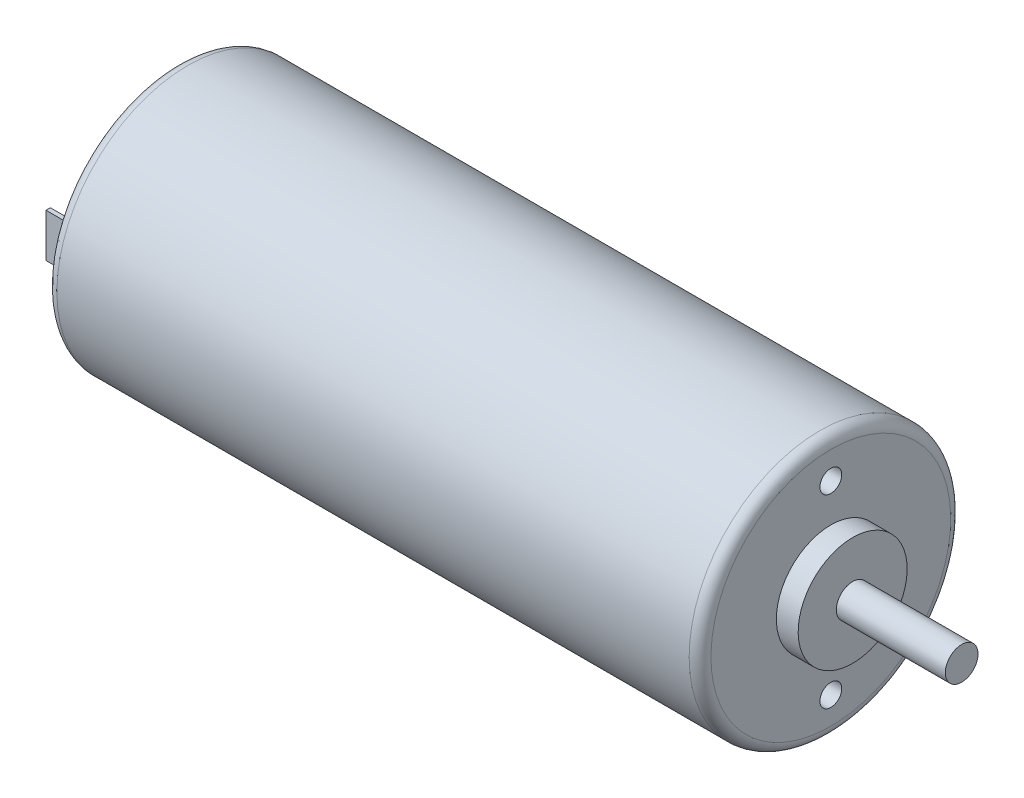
ISO-10303-21;
HEADER;
FILE_DESCRIPTION(('STEP AP214'),'2;1');
FILE_NAME('part.step','',(''),(''),'','','');
FILE_SCHEMA(('AUTOMOTIVE_DESIGN { 1 0 10303 214 1 1 1 1 }'));
ENDSEC;
DATA;
#1=APPLICATION_CONTEXT('core data for automotive mechanical design processes');
#2=APPLICATION_PROTOCOL_DEFINITION('international standard','automotive_design',2000,#1);
#3=PRODUCT_CONTEXT('',#1,'mechanical');
#4=PRODUCT('Part','Part','',(#3));
#5=PRODUCT_RELATED_PRODUCT_CATEGORY('part','',(#4));
#6=PRODUCT_DEFINITION_FORMATION('','',#4);
#7=PRODUCT_DEFINITION_CONTEXT('part definition',#1,'design');
#8=PRODUCT_DEFINITION('design','',#6,#7);
#9=PRODUCT_DEFINITION_SHAPE('','',#8);
#10=(LENGTH_UNIT() NAMED_UNIT(*) SI_UNIT(.MILLI.,.METRE.));
#11=(NAMED_UNIT(*) PLANE_ANGLE_UNIT() SI_UNIT($,.RADIAN.));
#12=(NAMED_UNIT(*) SI_UNIT($,.STERADIAN.) SOLID_ANGLE_UNIT());
#13=UNCERTAINTY_MEASURE_WITH_UNIT(LENGTH_MEASURE(1.E-05),#10,'distance_accuracy_value','');
#14=(GEOMETRIC_REPRESENTATION_CONTEXT(3) GLOBAL_UNCERTAINTY_ASSIGNED_CONTEXT((#13)) GLOBAL_UNIT_ASSIGNED_CONTEXT((#10,
#11,#12)) REPRESENTATION_CONTEXT('',''));
#15=CARTESIAN_POINT('',(0.,0.,0.));
#16=DIRECTION('',(0.,0.,1.));
#17=DIRECTION('',(1.,0.,0.));
#18=AXIS2_PLACEMENT_3D('',#15,#16,#17);
#19=CARTESIAN_POINT('',(-15.,2.49999999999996,0.));
#20=DIRECTION('',(-1.,0.,0.));
#21=DIRECTION('',(0.,-1.,0.));
#22=AXIS2_PLACEMENT_3D('',#19,#20,#21);
#23=PLANE('',#22);
#24=DIRECTION('',(0.,-1.,0.));
#25=VECTOR('',#24,1.);
#26=CARTESIAN_POINT('',(-15.,0.999999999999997,-4.));
#27=LINE('',#26,#25);
#28=CARTESIAN_POINT('',(-15.,0.999999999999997,-4.));
#29=VERTEX_POINT('',#28);
#30=CARTESIAN_POINT('',(-15.,-1.,-4.));
#31=VERTEX_POINT('',#30);
#32=EDGE_CURVE('E141',#29,#31,#27,.T.);
#33=ORIENTED_EDGE('',*,*,#32,.F.);
#34=DIRECTION('',(0.,0.,-1.));
#35=VECTOR('',#34,1.);
#36=CARTESIAN_POINT('',(-15.,0.999999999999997,-4.));
#37=LINE('',#36,#35);
#38=CARTESIAN_POINT('',(-15.,0.999999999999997,-3.8));
#39=VERTEX_POINT('',#38);
#40=EDGE_CURVE('E108',#39,#29,#37,.T.);
#41=ORIENTED_EDGE('',*,*,#40,.F.);
#42=DIRECTION('',(0.,1.,0.));
#43=VECTOR('',#42,1.);
#44=CARTESIAN_POINT('',(-15.,0.999999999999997,-3.8));
#45=LINE('',#44,#43);
#46=CARTESIAN_POINT('',(-15.,-1.,-3.8));
#47=VERTEX_POINT('',#46);
#48=EDGE_CURVE('E145',#47,#39,#45,.T.);
#49=ORIENTED_EDGE('',*,*,#48,.F.);
#50=DIRECTION('',(0.,0.,1.));
#51=VECTOR('',#50,1.);
#52=CARTESIAN_POINT('',(-15.,-1.,-3.8));
#53=LINE('',#52,#51);
#54=EDGE_CURVE('E143',#31,#47,#53,.T.);
#55=ORIENTED_EDGE('',*,*,#54,.F.);
#56=EDGE_LOOP('',(#33,#41,#49,#55));
#57=FACE_BOUND('',#56,.T.);
#58=CARTESIAN_POINT('',(-15.,0.,0.));
#59=DIRECTION('',(-1.,0.,0.));
#60=DIRECTION('',(0.,-1.,0.));
#61=AXIS2_PLACEMENT_3D('',#58,#59,#60);
#62=CIRCLE('',#61,5.49999999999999);
#63=CARTESIAN_POINT('',(-15.,-5.5,0.));
#64=VERTEX_POINT('',#63);
#65=EDGE_CURVE('E189',#64,#64,#62,.T.);
#66=ORIENTED_EDGE('',*,*,#65,.T.);
#67=EDGE_LOOP('',(#66));
#68=FACE_BOUND('',#67,.T.);
#69=CARTESIAN_POINT('',(-15.,0.,0.));
#70=DIRECTION('',(1.,0.,0.));
#71=DIRECTION('',(0.,1.,0.));
#72=AXIS2_PLACEMENT_3D('',#69,#70,#71);
#73=CIRCLE('',#72,2.49999999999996);
#74=CARTESIAN_POINT('',(-15.,2.49999999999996,0.));
#75=VERTEX_POINT('',#74);
#76=EDGE_CURVE('E177',#75,#75,#73,.T.);
#77=ORIENTED_EDGE('',*,*,#76,.T.);
#78=EDGE_LOOP('',(#77));
#79=FACE_BOUND('',#78,.T.);
#80=DIRECTION('',(0.,-1.,0.));
#81=VECTOR('',#80,1.);
#82=CARTESIAN_POINT('',(-15.,0.999999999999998,3.8));
#83=LINE('',#82,#81);
#84=CARTESIAN_POINT('',(-15.,0.999999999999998,3.8));
#85=VERTEX_POINT('',#84);
#86=CARTESIAN_POINT('',(-15.,-1.,3.8));
#87=VERTEX_POINT('',#86);
#88=EDGE_CURVE('E102',#85,#87,#83,.T.);
#89=ORIENTED_EDGE('',*,*,#88,.F.);
#90=DIRECTION('',(0.,0.,-1.));
#91=VECTOR('',#90,1.);
#92=CARTESIAN_POINT('',(-15.,0.999999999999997,4.));
#93=LINE('',#92,#91);
#94=CARTESIAN_POINT('',(-15.,0.999999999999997,4.));
#95=VERTEX_POINT('',#94);
#96=EDGE_CURVE('E113',#95,#85,#93,.T.);
#97=ORIENTED_EDGE('',*,*,#96,.F.);
#98=DIRECTION('',(0.,1.,0.));
#99=VECTOR('',#98,1.);
#100=CARTESIAN_POINT('',(-15.,0.999999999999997,4.));
#101=LINE('',#100,#99);
#102=CARTESIAN_POINT('',(-15.,-1.,4.));
#103=VERTEX_POINT('',#102);
#104=EDGE_CURVE('E124',#103,#95,#101,.T.);
#105=ORIENTED_EDGE('',*,*,#104,.F.);
#106=DIRECTION('',(0.,0.,1.));
#107=VECTOR('',#106,1.);
#108=CARTESIAN_POINT('',(-15.,-1.,3.8));
#109=LINE('',#108,#107);
#110=EDGE_CURVE('E122',#87,#103,#109,.T.);
#111=ORIENTED_EDGE('',*,*,#110,.F.);
#112=EDGE_LOOP('',(#89,#97,#105,#111));
#113=FACE_BOUND('',#112,.T.);
#114=ADVANCED_FACE('F31',(#57,#68,#79,#113),#23,.T.);
#115=CARTESIAN_POINT('',(-16.,0.,0.));
#116=DIRECTION('',(-1.,0.,0.));
#117=DIRECTION('',(0.,-1.,0.));
#118=AXIS2_PLACEMENT_3D('',#115,#116,#117);
#119=PLANE('',#118);
#120=CARTESIAN_POINT('',(-16.,0.,0.));
#121=DIRECTION('',(-1.,0.,0.));
#122=DIRECTION('',(0.,-1.,0.));
#123=AXIS2_PLACEMENT_3D('',#120,#121,#122);
#124=CIRCLE('',#123,1.99999999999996);
#125=CARTESIAN_POINT('',(-16.,-1.99999999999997,0.));
#126=VERTEX_POINT('',#125);
#127=EDGE_CURVE('E11',#126,#126,#124,.T.);
#128=ORIENTED_EDGE('',*,*,#127,.T.);
#129=EDGE_LOOP('',(#128));
#130=FACE_BOUND('',#129,.T.);
#131=ADVANCED_FACE('F33',(#130),#119,.T.);
#132=CARTESIAN_POINT('',(52.4688341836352,0.,0.));
#133=DIRECTION('',(1.,0.,0.));
#134=DIRECTION('',(0.,1.,0.));
#135=AXIS2_PLACEMENT_3D('',#132,#133,#134);
#136=CYLINDRICAL_SURFACE('',#135,2.49999999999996);
#137=CARTESIAN_POINT('',(-15.5,0.,0.));
#138=DIRECTION('',(-1.,0.,0.));
#139=DIRECTION('',(0.,-1.,0.));
#140=AXIS2_PLACEMENT_3D('',#137,#138,#139);
#141=CIRCLE('',#140,2.49999999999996);
#142=CARTESIAN_POINT('',(-15.5,-2.49999999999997,0.));
#143=VERTEX_POINT('',#142);
#144=EDGE_CURVE('E39',#143,#143,#141,.F.);
#145=ORIENTED_EDGE('',*,*,#144,.T.);
#146=EDGE_LOOP('',(#145));
#147=FACE_BOUND('',#146,.T.);
#148=ORIENTED_EDGE('',*,*,#76,.F.);
#149=EDGE_LOOP('',(#148));
#150=FACE_BOUND('',#149,.T.);
#151=ADVANCED_FACE('F194',(#147,#150),#136,.T.);
#152=CARTESIAN_POINT('',(52.4688341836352,0.,0.));
#153=DIRECTION('',(1.,0.,0.));
#154=DIRECTION('',(0.,1.,0.));
#155=AXIS2_PLACEMENT_3D('',#152,#153,#154);
#156=CYLINDRICAL_SURFACE('',#155,5.99999999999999);
#157=CARTESIAN_POINT('',(14.5,0.,0.));
#158=DIRECTION('',(1.,0.,0.));
#159=DIRECTION('',(0.,1.,0.));
#160=AXIS2_PLACEMENT_3D('',#157,#158,#159);
#161=CIRCLE('',#160,5.99999999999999);
#162=CARTESIAN_POINT('',(14.5,6.,0.));
#163=VERTEX_POINT('',#162);
#164=EDGE_CURVE('E186',#163,#163,#161,.F.);
#165=ORIENTED_EDGE('',*,*,#164,.T.);
#166=EDGE_LOOP('',(#165));
#167=FACE_BOUND('',#166,.T.);
#168=CARTESIAN_POINT('',(-14.5,0.,0.));
#169=DIRECTION('',(-1.,0.,0.));
#170=DIRECTION('',(0.,-1.,0.));
#171=AXIS2_PLACEMENT_3D('',#168,#169,#170);
#172=CIRCLE('',#171,5.99999999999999);
#173=CARTESIAN_POINT('',(-14.5,-6.,0.));
#174=VERTEX_POINT('',#173);
#175=EDGE_CURVE('E183',#174,#174,#172,.F.);
#176=ORIENTED_EDGE('',*,*,#175,.T.);
#177=EDGE_LOOP('',(#176));
#178=FACE_BOUND('',#177,.T.);
#179=ADVANCED_FACE('F224',(#167,#178),#156,.T.);
#180=CARTESIAN_POINT('',(15.,6.,0.));
#181=DIRECTION('',(1.,0.,0.));
#182=DIRECTION('',(0.,1.,0.));
#183=AXIS2_PLACEMENT_3D('',#180,#181,#182);
#184=PLANE('',#183);
#185=CARTESIAN_POINT('',(15.,4.25,0.));
#186=DIRECTION('',(1.,0.,0.));
#187=DIRECTION('',(0.,1.,0.));
#188=AXIS2_PLACEMENT_3D('',#185,#186,#187);
#189=CIRCLE('',#188,0.5);
#190=CARTESIAN_POINT('',(15.,4.75,0.));
#191=VERTEX_POINT('',#190);
#192=EDGE_CURVE('E436',#191,#191,#189,.T.);
#193=ORIENTED_EDGE('',*,*,#192,.F.);
#194=EDGE_LOOP('',(#193));
#195=FACE_BOUND('',#194,.T.);
#196=CARTESIAN_POINT('',(15.,-4.25,0.));
#197=DIRECTION('',(1.,0.,0.));
#198=DIRECTION('',(0.,1.,0.));
#199=AXIS2_PLACEMENT_3D('',#196,#197,#198);
#200=CIRCLE('',#199,0.5);
#201=CARTESIAN_POINT('',(15.,-3.75,0.));
#202=VERTEX_POINT('',#201);
#203=EDGE_CURVE('E435',#202,#202,#200,.T.);
#204=ORIENTED_EDGE('',*,*,#203,.F.);
#205=EDGE_LOOP('',(#204));
#206=FACE_BOUND('',#205,.T.);
#207=CARTESIAN_POINT('',(15.,0.,0.));
#208=DIRECTION('',(1.,0.,0.));
#209=DIRECTION('',(0.,1.,0.));
#210=AXIS2_PLACEMENT_3D('',#207,#208,#209);
#211=CIRCLE('',#210,5.49999999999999);
#212=CARTESIAN_POINT('',(15.,5.5,0.));
#213=VERTEX_POINT('',#212);
#214=EDGE_CURVE('E180',#213,#213,#211,.T.);
#215=ORIENTED_EDGE('',*,*,#214,.T.);
#216=EDGE_LOOP('',(#215));
#217=FACE_BOUND('',#216,.T.);
#218=CARTESIAN_POINT('',(15.,0.,0.));
#219=DIRECTION('',(1.,0.,0.));
#220=DIRECTION('',(0.,1.,0.));
#221=AXIS2_PLACEMENT_3D('',#218,#219,#220);
#222=CIRCLE('',#221,2.5);
#223=CARTESIAN_POINT('',(15.,2.5,0.));
#224=VERTEX_POINT('',#223);
#225=EDGE_CURVE('E174',#224,#224,#222,.T.);
#226=ORIENTED_EDGE('',*,*,#225,.F.);
#227=EDGE_LOOP('',(#226));
#228=FACE_BOUND('',#227,.T.);
#229=ADVANCED_FACE('F230',(#195,#206,#217,#228),#184,.T.);
#230=CARTESIAN_POINT('',(52.4688341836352,0.,0.));
#231=DIRECTION('',(1.,0.,0.));
#232=DIRECTION('',(0.,1.,0.));
#233=AXIS2_PLACEMENT_3D('',#230,#231,#232);
#234=CYLINDRICAL_SURFACE('',#233,2.5);
#235=ORIENTED_EDGE('',*,*,#225,.T.);
#236=EDGE_LOOP('',(#235));
#237=FACE_BOUND('',#236,.T.);
#238=CARTESIAN_POINT('',(16.,0.,0.));
#239=DIRECTION('',(1.,0.,0.));
#240=DIRECTION('',(0.,1.,0.));
#241=AXIS2_PLACEMENT_3D('',#238,#239,#240);
#242=CIRCLE('',#241,2.5);
#243=CARTESIAN_POINT('',(16.,2.5,0.));
#244=VERTEX_POINT('',#243);
#245=EDGE_CURVE('E171',#244,#244,#242,.T.);
#246=ORIENTED_EDGE('',*,*,#245,.F.);
#247=EDGE_LOOP('',(#246));
#248=FACE_BOUND('',#247,.T.);
#249=ADVANCED_FACE('F235',(#237,#248),#234,.T.);
#250=CARTESIAN_POINT('',(16.,2.5,0.));
#251=DIRECTION('',(1.,0.,0.));
#252=DIRECTION('',(0.,1.,0.));
#253=AXIS2_PLACEMENT_3D('',#250,#251,#252);
#254=PLANE('',#253);
#255=ORIENTED_EDGE('',*,*,#245,.T.);
#256=EDGE_LOOP('',(#255));
#257=FACE_BOUND('',#256,.T.);
#258=CARTESIAN_POINT('',(16.,0.,0.));
#259=DIRECTION('',(1.,0.,0.));
#260=DIRECTION('',(0.,1.,0.));
#261=AXIS2_PLACEMENT_3D('',#258,#259,#260);
#262=CIRCLE('',#261,0.749999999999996);
#263=CARTESIAN_POINT('',(16.,0.75,0.));
#264=VERTEX_POINT('',#263);
#265=EDGE_CURVE('E168',#264,#264,#262,.T.);
#266=ORIENTED_EDGE('',*,*,#265,.F.);
#267=EDGE_LOOP('',(#266));
#268=FACE_BOUND('',#267,.T.);
#269=ADVANCED_FACE('F253',(#257,#268),#254,.T.);
#270=CARTESIAN_POINT('',(52.4688341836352,0.,0.));
#271=DIRECTION('',(1.,0.,0.));
#272=DIRECTION('',(0.,1.,0.));
#273=AXIS2_PLACEMENT_3D('',#270,#271,#272);
#274=CYLINDRICAL_SURFACE('',#273,0.749999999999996);
#275=ORIENTED_EDGE('',*,*,#265,.T.);
#276=EDGE_LOOP('',(#275));
#277=FACE_BOUND('',#276,.T.);
#278=CARTESIAN_POINT('',(21.,0.,0.));
#279=DIRECTION('',(1.,0.,0.));
#280=DIRECTION('',(0.,1.,0.));
#281=AXIS2_PLACEMENT_3D('',#278,#279,#280);
#282=CIRCLE('',#281,0.749999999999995);
#283=CARTESIAN_POINT('',(21.,0.75,0.));
#284=VERTEX_POINT('',#283);
#285=EDGE_CURVE('E165',#284,#284,#282,.T.);
#286=ORIENTED_EDGE('',*,*,#285,.F.);
#287=EDGE_LOOP('',(#286));
#288=FACE_BOUND('',#287,.T.);
#289=ADVANCED_FACE('F259',(#277,#288),#274,.T.);
#290=CARTESIAN_POINT('',(21.,0.75,0.));
#291=DIRECTION('',(1.,0.,0.));
#292=DIRECTION('',(0.,1.,0.));
#293=AXIS2_PLACEMENT_3D('',#290,#291,#292);
#294=PLANE('',#293);
#295=ORIENTED_EDGE('',*,*,#285,.T.);
#296=EDGE_LOOP('',(#295));
#297=FACE_BOUND('',#296,.T.);
#298=ADVANCED_FACE('F244',(#297),#294,.T.);
#299=CARTESIAN_POINT('',(14.5,0.,0.));
#300=DIRECTION('',(1.,0.,0.));
#301=DIRECTION('',(0.,1.,0.));
#302=AXIS2_PLACEMENT_3D('',#299,#300,#301);
#303=TOROIDAL_SURFACE('',#302,5.49999999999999,0.5);
#304=ORIENTED_EDGE('',*,*,#164,.F.);
#305=EDGE_LOOP('',(#304));
#306=FACE_BOUND('',#305,.T.);
#307=ORIENTED_EDGE('',*,*,#214,.F.);
#308=EDGE_LOOP('',(#307));
#309=FACE_BOUND('',#308,.T.);
#310=ADVANCED_FACE('F210',(#306,#309),#303,.T.);
#311=CARTESIAN_POINT('',(-14.5,0.,0.));
#312=DIRECTION('',(-1.,0.,0.));
#313=DIRECTION('',(0.,-1.,0.));
#314=AXIS2_PLACEMENT_3D('',#311,#312,#313);
#315=TOROIDAL_SURFACE('',#314,5.49999999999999,0.5);
#316=ORIENTED_EDGE('',*,*,#65,.F.);
#317=EDGE_LOOP('',(#316));
#318=FACE_BOUND('',#317,.T.);
#319=ORIENTED_EDGE('',*,*,#175,.F.);
#320=EDGE_LOOP('',(#319));
#321=FACE_BOUND('',#320,.T.);
#322=ADVANCED_FACE('F200',(#318,#321),#315,.T.);
#323=CARTESIAN_POINT('',(-15.5,0.,0.));
#324=DIRECTION('',(-1.,0.,0.));
#325=DIRECTION('',(0.,-1.,0.));
#326=AXIS2_PLACEMENT_3D('',#323,#324,#325);
#327=TOROIDAL_SURFACE('',#326,1.99999999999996,0.5);
#328=ORIENTED_EDGE('',*,*,#127,.F.);
#329=EDGE_LOOP('',(#328));
#330=FACE_BOUND('',#329,.T.);
#331=ORIENTED_EDGE('',*,*,#144,.F.);
#332=EDGE_LOOP('',(#331));
#333=FACE_BOUND('',#332,.T.);
#334=ADVANCED_FACE('F197',(#330,#333),#327,.T.);
#335=CARTESIAN_POINT('',(-17.,0.999999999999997,-4.));
#336=DIRECTION('',(0.,-1.,0.));
#337=DIRECTION('',(1.,0.,0.));
#338=AXIS2_PLACEMENT_3D('',#335,#336,#337);
#339=PLANE('',#338);
#340=ORIENTED_EDGE('',*,*,#40,.T.);
#341=DIRECTION('',(1.,0.,0.));
#342=VECTOR('',#341,1.);
#343=CARTESIAN_POINT('',(-17.,0.999999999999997,-4.));
#344=LINE('',#343,#342);
#345=CARTESIAN_POINT('',(-17.,0.999999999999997,-4.));
#346=VERTEX_POINT('',#345);
#347=EDGE_CURVE('E163',#346,#29,#344,.T.);
#348=ORIENTED_EDGE('',*,*,#347,.F.);
#349=DIRECTION('',(0.,0.,-1.));
#350=VECTOR('',#349,1.);
#351=CARTESIAN_POINT('',(-17.,0.999999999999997,-4.));
#352=LINE('',#351,#350);
#353=CARTESIAN_POINT('',(-17.,0.999999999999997,-3.8));
#354=VERTEX_POINT('',#353);
#355=EDGE_CURVE('E147',#354,#346,#352,.T.);
#356=ORIENTED_EDGE('',*,*,#355,.F.);
#357=DIRECTION('',(1.,0.,0.));
#358=VECTOR('',#357,1.);
#359=CARTESIAN_POINT('',(-17.,0.999999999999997,-3.8));
#360=LINE('',#359,#358);
#361=EDGE_CURVE('E156',#354,#39,#360,.T.);
#362=ORIENTED_EDGE('',*,*,#361,.T.);
#363=EDGE_LOOP('',(#340,#348,#356,#362));
#364=FACE_BOUND('',#363,.T.);
#365=ADVANCED_FACE('F199',(#364),#339,.F.);
#366=CARTESIAN_POINT('',(-17.,0.999999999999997,-4.));
#367=DIRECTION('',(0.,0.,1.));
#368=DIRECTION('',(1.,0.,0.));
#369=AXIS2_PLACEMENT_3D('',#366,#367,#368);
#370=PLANE('',#369);
#371=ORIENTED_EDGE('',*,*,#32,.T.);
#372=DIRECTION('',(1.,0.,0.));
#373=VECTOR('',#372,1.);
#374=CARTESIAN_POINT('',(-17.,-1.,-4.));
#375=LINE('',#374,#373);
#376=CARTESIAN_POINT('',(-17.,-1.,-4.));
#377=VERTEX_POINT('',#376);
#378=EDGE_CURVE('E160',#377,#31,#375,.T.);
#379=ORIENTED_EDGE('',*,*,#378,.F.);
#380=DIRECTION('',(0.,-1.,0.));
#381=VECTOR('',#380,1.);
#382=CARTESIAN_POINT('',(-17.,0.999999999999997,-4.));
#383=LINE('',#382,#381);
#384=EDGE_CURVE('E150',#346,#377,#383,.T.);
#385=ORIENTED_EDGE('',*,*,#384,.F.);
#386=ORIENTED_EDGE('',*,*,#347,.T.);
#387=EDGE_LOOP('',(#371,#379,#385,#386));
#388=FACE_BOUND('',#387,.T.);
#389=ADVANCED_FACE('F207',(#388),#370,.F.);
#390=CARTESIAN_POINT('',(-17.,-1.,-3.8));
#391=DIRECTION('',(0.,1.,0.));
#392=DIRECTION('',(-1.,0.,0.));
#393=AXIS2_PLACEMENT_3D('',#390,#391,#392);
#394=PLANE('',#393);
#395=ORIENTED_EDGE('',*,*,#54,.T.);
#396=DIRECTION('',(1.,0.,0.));
#397=VECTOR('',#396,1.);
#398=CARTESIAN_POINT('',(-17.,-1.,-3.8));
#399=LINE('',#398,#397);
#400=CARTESIAN_POINT('',(-17.,-1.,-3.8));
#401=VERTEX_POINT('',#400);
#402=EDGE_CURVE('E54',#401,#47,#399,.T.);
#403=ORIENTED_EDGE('',*,*,#402,.F.);
#404=DIRECTION('',(0.,0.,1.));
#405=VECTOR('',#404,1.);
#406=CARTESIAN_POINT('',(-17.,-1.,-3.8));
#407=LINE('',#406,#405);
#408=EDGE_CURVE('E152',#377,#401,#407,.T.);
#409=ORIENTED_EDGE('',*,*,#408,.F.);
#410=ORIENTED_EDGE('',*,*,#378,.T.);
#411=EDGE_LOOP('',(#395,#403,#409,#410));
#412=FACE_BOUND('',#411,.T.);
#413=ADVANCED_FACE('F306',(#412),#394,.F.);
#414=CARTESIAN_POINT('',(-17.,0.999999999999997,-3.8));
#415=DIRECTION('',(0.,0.,-1.));
#416=DIRECTION('',(0.,1.,0.));
#417=AXIS2_PLACEMENT_3D('',#414,#415,#416);
#418=PLANE('',#417);
#419=ORIENTED_EDGE('',*,*,#48,.T.);
#420=ORIENTED_EDGE('',*,*,#361,.F.);
#421=DIRECTION('',(0.,1.,0.));
#422=VECTOR('',#421,1.);
#423=CARTESIAN_POINT('',(-17.,0.999999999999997,-3.8));
#424=LINE('',#423,#422);
#425=EDGE_CURVE('E154',#401,#354,#424,.T.);
#426=ORIENTED_EDGE('',*,*,#425,.F.);
#427=ORIENTED_EDGE('',*,*,#402,.T.);
#428=EDGE_LOOP('',(#419,#420,#426,#427));
#429=FACE_BOUND('',#428,.T.);
#430=ADVANCED_FACE('F316',(#429),#418,.F.);
#431=CARTESIAN_POINT('',(-17.,0.999999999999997,-4.));
#432=DIRECTION('',(1.,0.,0.));
#433=DIRECTION('',(0.,0.,-1.));
#434=AXIS2_PLACEMENT_3D('',#431,#432,#433);
#435=PLANE('',#434);
#436=ORIENTED_EDGE('',*,*,#355,.T.);
#437=ORIENTED_EDGE('',*,*,#384,.T.);
#438=ORIENTED_EDGE('',*,*,#408,.T.);
#439=ORIENTED_EDGE('',*,*,#425,.T.);
#440=EDGE_LOOP('',(#436,#437,#438,#439));
#441=FACE_BOUND('',#440,.T.);
#442=ADVANCED_FACE('F326',(#441),#435,.F.);
#443=CARTESIAN_POINT('',(-17.,0.999999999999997,4.));
#444=DIRECTION('',(0.,-1.,0.));
#445=DIRECTION('',(0.,0.,-1.));
#446=AXIS2_PLACEMENT_3D('',#443,#444,#445);
#447=PLANE('',#446);
#448=ORIENTED_EDGE('',*,*,#96,.T.);
#449=DIRECTION('',(1.,0.,0.));
#450=VECTOR('',#449,1.);
#451=CARTESIAN_POINT('',(-17.,0.999999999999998,3.8));
#452=LINE('',#451,#450);
#453=CARTESIAN_POINT('',(-17.,0.999999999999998,3.8));
#454=VERTEX_POINT('',#453);
#455=EDGE_CURVE('E97',#454,#85,#452,.T.);
#456=ORIENTED_EDGE('',*,*,#455,.F.);
#457=DIRECTION('',(0.,0.,-1.));
#458=VECTOR('',#457,1.);
#459=CARTESIAN_POINT('',(-17.,0.999999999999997,4.));
#460=LINE('',#459,#458);
#461=CARTESIAN_POINT('',(-17.,0.999999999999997,4.));
#462=VERTEX_POINT('',#461);
#463=EDGE_CURVE('E129',#462,#454,#460,.T.);
#464=ORIENTED_EDGE('',*,*,#463,.F.);
#465=DIRECTION('',(1.,0.,0.));
#466=VECTOR('',#465,1.);
#467=CARTESIAN_POINT('',(-17.,0.999999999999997,4.));
#468=LINE('',#467,#466);
#469=EDGE_CURVE('E116',#462,#95,#468,.T.);
#470=ORIENTED_EDGE('',*,*,#469,.T.);
#471=EDGE_LOOP('',(#448,#456,#464,#470));
#472=FACE_BOUND('',#471,.T.);
#473=ADVANCED_FACE('F114',(#472),#447,.F.);
#474=CARTESIAN_POINT('',(-17.,0.999999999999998,3.8));
#475=DIRECTION('',(0.,0.,1.));
#476=DIRECTION('',(1.,0.,0.));
#477=AXIS2_PLACEMENT_3D('',#474,#475,#476);
#478=PLANE('',#477);
#479=ORIENTED_EDGE('',*,*,#88,.T.);
#480=DIRECTION('',(1.,0.,0.));
#481=VECTOR('',#480,1.);
#482=CARTESIAN_POINT('',(-17.,-1.,3.8));
#483=LINE('',#482,#481);
#484=CARTESIAN_POINT('',(-17.,-1.,3.8));
#485=VERTEX_POINT('',#484);
#486=EDGE_CURVE('E109',#485,#87,#483,.T.);
#487=ORIENTED_EDGE('',*,*,#486,.F.);
#488=DIRECTION('',(0.,-1.,0.));
#489=VECTOR('',#488,1.);
#490=CARTESIAN_POINT('',(-17.,0.999999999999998,3.8));
#491=LINE('',#490,#489);
#492=EDGE_CURVE('E104',#454,#485,#491,.T.);
#493=ORIENTED_EDGE('',*,*,#492,.F.);
#494=ORIENTED_EDGE('',*,*,#455,.T.);
#495=EDGE_LOOP('',(#479,#487,#493,#494));
#496=FACE_BOUND('',#495,.T.);
#497=ADVANCED_FACE('F99',(#496),#478,.F.);
#498=CARTESIAN_POINT('',(-17.,-1.,3.8));
#499=DIRECTION('',(0.,1.,0.));
#500=DIRECTION('',(0.,0.,1.));
#501=AXIS2_PLACEMENT_3D('',#498,#499,#500);
#502=PLANE('',#501);
#503=ORIENTED_EDGE('',*,*,#110,.T.);
#504=DIRECTION('',(1.,0.,0.));
#505=VECTOR('',#504,1.);
#506=CARTESIAN_POINT('',(-17.,-1.,4.));
#507=LINE('',#506,#505);
#508=CARTESIAN_POINT('',(-17.,-1.,4.));
#509=VERTEX_POINT('',#508);
#510=EDGE_CURVE('E46',#509,#103,#507,.T.);
#511=ORIENTED_EDGE('',*,*,#510,.F.);
#512=DIRECTION('',(0.,0.,1.));
#513=VECTOR('',#512,1.);
#514=CARTESIAN_POINT('',(-17.,-1.,3.8));
#515=LINE('',#514,#513);
#516=EDGE_CURVE('E132',#485,#509,#515,.T.);
#517=ORIENTED_EDGE('',*,*,#516,.F.);
#518=ORIENTED_EDGE('',*,*,#486,.T.);
#519=EDGE_LOOP('',(#503,#511,#517,#518));
#520=FACE_BOUND('',#519,.T.);
#521=ADVANCED_FACE('F352',(#520),#502,.F.);
#522=CARTESIAN_POINT('',(-17.,0.999999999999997,4.));
#523=DIRECTION('',(0.,0.,-1.));
#524=DIRECTION('',(-1.,0.,0.));
#525=AXIS2_PLACEMENT_3D('',#522,#523,#524);
#526=PLANE('',#525);
#527=ORIENTED_EDGE('',*,*,#104,.T.);
#528=ORIENTED_EDGE('',*,*,#469,.F.);
#529=DIRECTION('',(0.,1.,0.));
#530=VECTOR('',#529,1.);
#531=CARTESIAN_POINT('',(-17.,0.999999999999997,4.));
#532=LINE('',#531,#530);
#533=EDGE_CURVE('E134',#509,#462,#532,.T.);
#534=ORIENTED_EDGE('',*,*,#533,.F.);
#535=ORIENTED_EDGE('',*,*,#510,.T.);
#536=EDGE_LOOP('',(#527,#528,#534,#535));
#537=FACE_BOUND('',#536,.T.);
#538=ADVANCED_FACE('F361',(#537),#526,.F.);
#539=CARTESIAN_POINT('',(-17.,0.999999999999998,3.8));
#540=DIRECTION('',(-1.,0.,0.));
#541=DIRECTION('',(0.,0.,1.));
#542=AXIS2_PLACEMENT_3D('',#539,#540,#541);
#543=PLANE('',#542);
#544=ORIENTED_EDGE('',*,*,#463,.T.);
#545=ORIENTED_EDGE('',*,*,#492,.T.);
#546=ORIENTED_EDGE('',*,*,#516,.T.);
#547=ORIENTED_EDGE('',*,*,#533,.T.);
#548=EDGE_LOOP('',(#544,#545,#546,#547));
#549=FACE_BOUND('',#548,.T.);
#550=ADVANCED_FACE('F371',(#549),#543,.T.);
#551=CARTESIAN_POINT('',(13.,-4.25,0.));
#552=DIRECTION('',(1.,0.,0.));
#553=DIRECTION('',(0.,1.,0.));
#554=AXIS2_PLACEMENT_3D('',#551,#552,#553);
#555=CYLINDRICAL_SURFACE('',#554,0.5);
#556=CARTESIAN_POINT('',(13.,-4.25,0.));
#557=DIRECTION('',(1.,0.,0.));
#558=DIRECTION('',(0.,1.,0.));
#559=AXIS2_PLACEMENT_3D('',#556,#557,#558);
#560=CIRCLE('',#559,0.5);
#561=CARTESIAN_POINT('',(13.,-3.75,0.));
#562=VERTEX_POINT('',#561);
#563=EDGE_CURVE('E119',#562,#562,#560,.T.);
#564=ORIENTED_EDGE('',*,*,#563,.F.);
#565=EDGE_LOOP('',(#564));
#566=FACE_BOUND('',#565,.T.);
#567=ORIENTED_EDGE('',*,*,#203,.T.);
#568=EDGE_LOOP('',(#567));
#569=FACE_BOUND('',#568,.T.);
#570=ADVANCED_FACE('F380',(#566,#569),#555,.F.);
#571=CARTESIAN_POINT('',(13.,-4.25,0.));
#572=DIRECTION('',(1.,0.,0.));
#573=DIRECTION('',(0.,1.,0.));
#574=AXIS2_PLACEMENT_3D('',#571,#572,#573);
#575=PLANE('',#574);
#576=ORIENTED_EDGE('',*,*,#563,.T.);
#577=EDGE_LOOP('',(#576));
#578=FACE_BOUND('',#577,.T.);
#579=ADVANCED_FACE('F398',(#578),#575,.T.);
#580=CARTESIAN_POINT('',(13.,4.25,0.));
#581=DIRECTION('',(1.,0.,0.));
#582=DIRECTION('',(0.,1.,0.));
#583=AXIS2_PLACEMENT_3D('',#580,#581,#582);
#584=CYLINDRICAL_SURFACE('',#583,0.5);
#585=CARTESIAN_POINT('',(13.,4.25,0.));
#586=DIRECTION('',(1.,0.,0.));
#587=DIRECTION('',(0.,1.,0.));
#588=AXIS2_PLACEMENT_3D('',#585,#586,#587);
#589=CIRCLE('',#588,0.5);
#590=CARTESIAN_POINT('',(13.,4.75,0.));
#591=VERTEX_POINT('',#590);
#592=EDGE_CURVE('E434',#591,#591,#589,.T.);
#593=ORIENTED_EDGE('',*,*,#592,.F.);
#594=EDGE_LOOP('',(#593));
#595=FACE_BOUND('',#594,.T.);
#596=ORIENTED_EDGE('',*,*,#192,.T.);
#597=EDGE_LOOP('',(#596));
#598=FACE_BOUND('',#597,.T.);
#599=ADVANCED_FACE('F408',(#595,#598),#584,.F.);
#600=CARTESIAN_POINT('',(13.,4.25,0.));
#601=DIRECTION('',(1.,0.,0.));
#602=DIRECTION('',(0.,1.,0.));
#603=AXIS2_PLACEMENT_3D('',#600,#601,#602);
#604=PLANE('',#603);
#605=ORIENTED_EDGE('',*,*,#592,.T.);
#606=EDGE_LOOP('',(#605));
#607=FACE_BOUND('',#606,.T.);
#608=ADVANCED_FACE('F418',(#607),#604,.T.);
#609=CLOSED_SHELL('',(#114,#131,#151,#179,#229,#249,#269,#289,#298,#310,#322,#334,#365,#389,
#413,#430,#442,#473,#497,#521,#538,#550,#570,#579,#599,#608));
#610=MANIFOLD_SOLID_BREP('B2',#609);
#611=ADVANCED_BREP_SHAPE_REPRESENTATION('',(#18,#610),#14);
#612=SHAPE_DEFINITION_REPRESENTATION(#9,#611);
ENDSEC;
END-ISO-10303-21;
